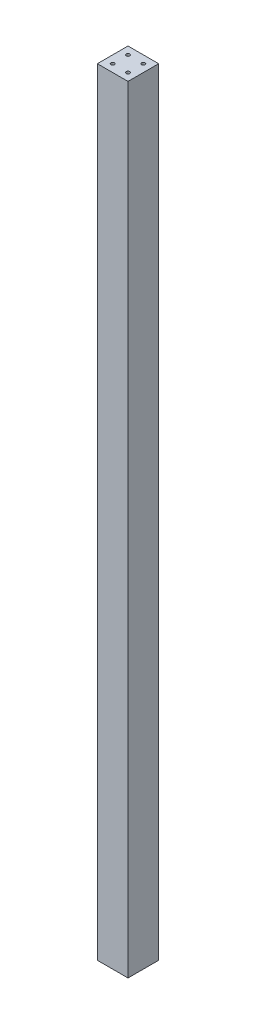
ISO-10303-21;
HEADER;
FILE_DESCRIPTION(('STEP AP214'),'2;1');
FILE_NAME('part.step','',(''),(''),'','','');
FILE_SCHEMA(('AUTOMOTIVE_DESIGN { 1 0 10303 214 1 1 1 1 }'));
ENDSEC;
DATA;
#1=APPLICATION_CONTEXT('core data for automotive mechanical design processes');
#2=APPLICATION_PROTOCOL_DEFINITION('international standard','automotive_design',2000,#1);
#3=PRODUCT_CONTEXT('',#1,'mechanical');
#4=PRODUCT('Part','Part','',(#3));
#5=PRODUCT_RELATED_PRODUCT_CATEGORY('part','',(#4));
#6=PRODUCT_DEFINITION_FORMATION('','',#4);
#7=PRODUCT_DEFINITION_CONTEXT('part definition',#1,'design');
#8=PRODUCT_DEFINITION('design','',#6,#7);
#9=PRODUCT_DEFINITION_SHAPE('','',#8);
#10=(LENGTH_UNIT() NAMED_UNIT(*) SI_UNIT(.MILLI.,.METRE.));
#11=(NAMED_UNIT(*) PLANE_ANGLE_UNIT() SI_UNIT($,.RADIAN.));
#12=(NAMED_UNIT(*) SI_UNIT($,.STERADIAN.) SOLID_ANGLE_UNIT());
#13=UNCERTAINTY_MEASURE_WITH_UNIT(LENGTH_MEASURE(1.E-05),#10,'distance_accuracy_value','');
#14=(GEOMETRIC_REPRESENTATION_CONTEXT(3) GLOBAL_UNCERTAINTY_ASSIGNED_CONTEXT((#13)) GLOBAL_UNIT_ASSIGNED_CONTEXT((#10,
#11,#12)) REPRESENTATION_CONTEXT('',''));
#15=CARTESIAN_POINT('',(0.,0.,0.));
#16=DIRECTION('',(0.,0.,1.));
#17=DIRECTION('',(1.,0.,0.));
#18=AXIS2_PLACEMENT_3D('',#15,#16,#17);
#19=CARTESIAN_POINT('',(-15.,1520.,15.));
#20=DIRECTION('',(0.,1.,0.));
#21=DIRECTION('',(0.,0.,1.));
#22=AXIS2_PLACEMENT_3D('',#19,#20,#21);
#23=CYLINDRICAL_SURFACE('',#22,3.39999999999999);
#24=CARTESIAN_POINT('',(-15.,1502.29292610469,15.));
#25=DIRECTION('',(0.,1.,0.));
#26=DIRECTION('',(0.,0.,1.));
#27=AXIS2_PLACEMENT_3D('',#24,#25,#26);
#28=CIRCLE('',#27,3.4);
#29=CARTESIAN_POINT('',(-15.,1502.29292610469,18.4));
#30=VERTEX_POINT('',#29);
#31=EDGE_CURVE('E11',#30,#30,#28,.T.);
#32=ORIENTED_EDGE('',*,*,#31,.F.);
#33=EDGE_LOOP('',(#32));
#34=FACE_BOUND('',#33,.T.);
#35=CARTESIAN_POINT('',(-15.,1520.,15.));
#36=DIRECTION('',(0.,1.,0.));
#37=DIRECTION('',(0.,0.,1.));
#38=AXIS2_PLACEMENT_3D('',#35,#36,#37);
#39=CIRCLE('',#38,3.39999999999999);
#40=CARTESIAN_POINT('',(-15.,1520.,18.4));
#41=VERTEX_POINT('',#40);
#42=EDGE_CURVE('E61',#41,#41,#39,.T.);
#43=ORIENTED_EDGE('',*,*,#42,.T.);
#44=EDGE_LOOP('',(#43));
#45=FACE_BOUND('',#44,.T.);
#46=ADVANCED_FACE('F53',(#34,#45),#23,.F.);
#47=CARTESIAN_POINT('',(-15.,1502.29292610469,15.));
#48=DIRECTION('',(0.,1.,0.));
#49=DIRECTION('',(0.,0.,1.));
#50=AXIS2_PLACEMENT_3D('',#47,#48,#49);
#51=CONICAL_SURFACE('',#50,3.4,1.02974425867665);
#52=CARTESIAN_POINT('',(-15.,1500.25,15.));
#53=VERTEX_POINT('',#52);
#54=VERTEX_LOOP('',#53);
#55=FACE_BOUND('',#54,.T.);
#56=ORIENTED_EDGE('',*,*,#31,.T.);
#57=EDGE_LOOP('',(#56));
#58=FACE_BOUND('',#57,.T.);
#59=ADVANCED_FACE('F242',(#55,#58),#51,.F.);
#60=CARTESIAN_POINT('',(15.,1520.,15.));
#61=DIRECTION('',(0.,1.,0.));
#62=DIRECTION('',(0.,0.,1.));
#63=AXIS2_PLACEMENT_3D('',#60,#61,#62);
#64=CYLINDRICAL_SURFACE('',#63,3.39999999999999);
#65=CARTESIAN_POINT('',(15.,1502.29292610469,15.));
#66=DIRECTION('',(0.,1.,0.));
#67=DIRECTION('',(0.,0.,1.));
#68=AXIS2_PLACEMENT_3D('',#65,#66,#67);
#69=CIRCLE('',#68,3.4);
#70=CARTESIAN_POINT('',(15.,1502.29292610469,18.4));
#71=VERTEX_POINT('',#70);
#72=EDGE_CURVE('E213',#71,#71,#69,.T.);
#73=ORIENTED_EDGE('',*,*,#72,.F.);
#74=EDGE_LOOP('',(#73));
#75=FACE_BOUND('',#74,.T.);
#76=CARTESIAN_POINT('',(15.,1520.,15.));
#77=DIRECTION('',(0.,1.,0.));
#78=DIRECTION('',(0.,0.,1.));
#79=AXIS2_PLACEMENT_3D('',#76,#77,#78);
#80=CIRCLE('',#79,3.39999999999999);
#81=CARTESIAN_POINT('',(15.,1520.,18.4));
#82=VERTEX_POINT('',#81);
#83=EDGE_CURVE('E209',#82,#82,#80,.T.);
#84=ORIENTED_EDGE('',*,*,#83,.T.);
#85=EDGE_LOOP('',(#84));
#86=FACE_BOUND('',#85,.T.);
#87=ADVANCED_FACE('F248',(#75,#86),#64,.F.);
#88=CARTESIAN_POINT('',(15.,1502.29292610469,15.));
#89=DIRECTION('',(0.,1.,0.));
#90=DIRECTION('',(0.,0.,1.));
#91=AXIS2_PLACEMENT_3D('',#88,#89,#90);
#92=CONICAL_SURFACE('',#91,3.4,1.02974425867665);
#93=CARTESIAN_POINT('',(15.,1500.25,15.));
#94=VERTEX_POINT('',#93);
#95=VERTEX_LOOP('',#94);
#96=FACE_BOUND('',#95,.T.);
#97=ORIENTED_EDGE('',*,*,#72,.T.);
#98=EDGE_LOOP('',(#97));
#99=FACE_BOUND('',#98,.T.);
#100=ADVANCED_FACE('F255',(#96,#99),#92,.F.);
#101=CARTESIAN_POINT('',(-15.,0.,15.));
#102=DIRECTION('',(0.,-1.,0.));
#103=DIRECTION('',(0.,0.,-1.));
#104=AXIS2_PLACEMENT_3D('',#101,#102,#103);
#105=CYLINDRICAL_SURFACE('',#104,3.39999999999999);
#106=CARTESIAN_POINT('',(-15.,17.7070738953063,15.));
#107=DIRECTION('',(0.,-1.,0.));
#108=DIRECTION('',(0.,0.,-1.));
#109=AXIS2_PLACEMENT_3D('',#106,#107,#108);
#110=CIRCLE('',#109,3.4);
#111=CARTESIAN_POINT('',(-15.,17.7070738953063,11.6));
#112=VERTEX_POINT('',#111);
#113=EDGE_CURVE('E205',#112,#112,#110,.T.);
#114=ORIENTED_EDGE('',*,*,#113,.F.);
#115=EDGE_LOOP('',(#114));
#116=FACE_BOUND('',#115,.T.);
#117=CARTESIAN_POINT('',(-15.,0.,15.));
#118=DIRECTION('',(0.,-1.,0.));
#119=DIRECTION('',(0.,0.,-1.));
#120=AXIS2_PLACEMENT_3D('',#117,#118,#119);
#121=CIRCLE('',#120,3.39999999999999);
#122=CARTESIAN_POINT('',(-15.,0.,11.6));
#123=VERTEX_POINT('',#122);
#124=EDGE_CURVE('E201',#123,#123,#121,.T.);
#125=ORIENTED_EDGE('',*,*,#124,.T.);
#126=EDGE_LOOP('',(#125));
#127=FACE_BOUND('',#126,.T.);
#128=ADVANCED_FACE('F260',(#116,#127),#105,.F.);
#129=CARTESIAN_POINT('',(-15.,17.7070738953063,15.));
#130=DIRECTION('',(0.,-1.,0.));
#131=DIRECTION('',(0.,0.,-1.));
#132=AXIS2_PLACEMENT_3D('',#129,#130,#131);
#133=CONICAL_SURFACE('',#132,3.4,1.02974425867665);
#134=CARTESIAN_POINT('',(-15.,19.75,15.));
#135=VERTEX_POINT('',#134);
#136=VERTEX_LOOP('',#135);
#137=FACE_BOUND('',#136,.T.);
#138=ORIENTED_EDGE('',*,*,#113,.T.);
#139=EDGE_LOOP('',(#138));
#140=FACE_BOUND('',#139,.T.);
#141=ADVANCED_FACE('F263',(#137,#140),#133,.F.);
#142=CARTESIAN_POINT('',(15.,0.,15.));
#143=DIRECTION('',(0.,-1.,0.));
#144=DIRECTION('',(0.,0.,-1.));
#145=AXIS2_PLACEMENT_3D('',#142,#143,#144);
#146=CYLINDRICAL_SURFACE('',#145,3.39999999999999);
#147=CARTESIAN_POINT('',(15.,17.7070738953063,15.));
#148=DIRECTION('',(0.,-1.,0.));
#149=DIRECTION('',(0.,0.,-1.));
#150=AXIS2_PLACEMENT_3D('',#147,#148,#149);
#151=CIRCLE('',#150,3.4);
#152=CARTESIAN_POINT('',(15.,17.7070738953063,11.6));
#153=VERTEX_POINT('',#152);
#154=EDGE_CURVE('E197',#153,#153,#151,.T.);
#155=ORIENTED_EDGE('',*,*,#154,.F.);
#156=EDGE_LOOP('',(#155));
#157=FACE_BOUND('',#156,.T.);
#158=CARTESIAN_POINT('',(15.,0.,15.));
#159=DIRECTION('',(0.,-1.,0.));
#160=DIRECTION('',(0.,0.,-1.));
#161=AXIS2_PLACEMENT_3D('',#158,#159,#160);
#162=CIRCLE('',#161,3.39999999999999);
#163=CARTESIAN_POINT('',(15.,0.,11.6));
#164=VERTEX_POINT('',#163);
#165=EDGE_CURVE('E193',#164,#164,#162,.T.);
#166=ORIENTED_EDGE('',*,*,#165,.T.);
#167=EDGE_LOOP('',(#166));
#168=FACE_BOUND('',#167,.T.);
#169=ADVANCED_FACE('F267',(#157,#168),#146,.F.);
#170=CARTESIAN_POINT('',(15.,17.7070738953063,15.));
#171=DIRECTION('',(0.,-1.,0.));
#172=DIRECTION('',(0.,0.,-1.));
#173=AXIS2_PLACEMENT_3D('',#170,#171,#172);
#174=CONICAL_SURFACE('',#173,3.4,1.02974425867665);
#175=CARTESIAN_POINT('',(15.,19.75,15.));
#176=VERTEX_POINT('',#175);
#177=VERTEX_LOOP('',#176);
#178=FACE_BOUND('',#177,.T.);
#179=ORIENTED_EDGE('',*,*,#154,.T.);
#180=EDGE_LOOP('',(#179));
#181=FACE_BOUND('',#180,.T.);
#182=ADVANCED_FACE('F271',(#178,#181),#174,.F.);
#183=CARTESIAN_POINT('',(30.,1520.,-30.));
#184=DIRECTION('',(-1.,0.,0.));
#185=DIRECTION('',(0.,0.,1.));
#186=AXIS2_PLACEMENT_3D('',#183,#184,#185);
#187=PLANE('',#186);
#188=DIRECTION('',(0.,0.,-1.));
#189=VECTOR('',#188,1.);
#190=CARTESIAN_POINT('',(30.,0.,-30.));
#191=LINE('',#190,#189);
#192=CARTESIAN_POINT('',(30.,0.,30.));
#193=VERTEX_POINT('',#192);
#194=CARTESIAN_POINT('',(30.,0.,-30.));
#195=VERTEX_POINT('',#194);
#196=EDGE_CURVE('E151',#193,#195,#191,.T.);
#197=ORIENTED_EDGE('',*,*,#196,.T.);
#198=DIRECTION('',(0.,-1.,0.));
#199=VECTOR('',#198,1.);
#200=CARTESIAN_POINT('',(30.,1520.,-30.));
#201=LINE('',#200,#199);
#202=CARTESIAN_POINT('',(30.,1520.,-30.));
#203=VERTEX_POINT('',#202);
#204=EDGE_CURVE('E189',#203,#195,#201,.T.);
#205=ORIENTED_EDGE('',*,*,#204,.F.);
#206=DIRECTION('',(0.,0.,-1.));
#207=VECTOR('',#206,1.);
#208=CARTESIAN_POINT('',(30.,1520.,-30.));
#209=LINE('',#208,#207);
#210=CARTESIAN_POINT('',(30.,1520.,30.));
#211=VERTEX_POINT('',#210);
#212=EDGE_CURVE('E152',#211,#203,#209,.T.);
#213=ORIENTED_EDGE('',*,*,#212,.F.);
#214=DIRECTION('',(0.,-1.,0.));
#215=VECTOR('',#214,1.);
#216=CARTESIAN_POINT('',(30.,1520.,30.));
#217=LINE('',#216,#215);
#218=EDGE_CURVE('E166',#211,#193,#217,.T.);
#219=ORIENTED_EDGE('',*,*,#218,.T.);
#220=EDGE_LOOP('',(#197,#205,#213,#219));
#221=FACE_BOUND('',#220,.T.);
#222=ADVANCED_FACE('F275',(#221),#187,.F.);
#223=CARTESIAN_POINT('',(-30.,1520.,-30.));
#224=DIRECTION('',(0.,0.,1.));
#225=DIRECTION('',(1.,0.,0.));
#226=AXIS2_PLACEMENT_3D('',#223,#224,#225);
#227=PLANE('',#226);
#228=DIRECTION('',(-1.,0.,0.));
#229=VECTOR('',#228,1.);
#230=CARTESIAN_POINT('',(-30.,0.,-30.));
#231=LINE('',#230,#229);
#232=CARTESIAN_POINT('',(-30.,0.,-30.));
#233=VERTEX_POINT('',#232);
#234=EDGE_CURVE('E170',#195,#233,#231,.T.);
#235=ORIENTED_EDGE('',*,*,#234,.T.);
#236=DIRECTION('',(0.,-1.,0.));
#237=VECTOR('',#236,1.);
#238=CARTESIAN_POINT('',(-30.,1520.,-30.));
#239=LINE('',#238,#237);
#240=CARTESIAN_POINT('',(-30.,1520.,-30.));
#241=VERTEX_POINT('',#240);
#242=EDGE_CURVE('E185',#241,#233,#239,.T.);
#243=ORIENTED_EDGE('',*,*,#242,.F.);
#244=DIRECTION('',(-1.,0.,0.));
#245=VECTOR('',#244,1.);
#246=CARTESIAN_POINT('',(-30.,1520.,-30.));
#247=LINE('',#246,#245);
#248=EDGE_CURVE('E156',#203,#241,#247,.T.);
#249=ORIENTED_EDGE('',*,*,#248,.F.);
#250=ORIENTED_EDGE('',*,*,#204,.T.);
#251=EDGE_LOOP('',(#235,#243,#249,#250));
#252=FACE_BOUND('',#251,.T.);
#253=ADVANCED_FACE('F279',(#252),#227,.F.);
#254=CARTESIAN_POINT('',(-30.,1520.,-30.));
#255=DIRECTION('',(1.,0.,0.));
#256=DIRECTION('',(0.,0.,-1.));
#257=AXIS2_PLACEMENT_3D('',#254,#255,#256);
#258=PLANE('',#257);
#259=DIRECTION('',(0.,0.,1.));
#260=VECTOR('',#259,1.);
#261=CARTESIAN_POINT('',(-30.,0.,-30.));
#262=LINE('',#261,#260);
#263=CARTESIAN_POINT('',(-30.,0.,30.));
#264=VERTEX_POINT('',#263);
#265=EDGE_CURVE('E173',#233,#264,#262,.T.);
#266=ORIENTED_EDGE('',*,*,#265,.T.);
#267=DIRECTION('',(0.,-1.,0.));
#268=VECTOR('',#267,1.);
#269=CARTESIAN_POINT('',(-30.,1520.,30.));
#270=LINE('',#269,#268);
#271=CARTESIAN_POINT('',(-30.,1520.,30.));
#272=VERTEX_POINT('',#271);
#273=EDGE_CURVE('E181',#272,#264,#270,.T.);
#274=ORIENTED_EDGE('',*,*,#273,.F.);
#275=DIRECTION('',(0.,0.,1.));
#276=VECTOR('',#275,1.);
#277=CARTESIAN_POINT('',(-30.,1520.,-30.));
#278=LINE('',#277,#276);
#279=EDGE_CURVE('E160',#241,#272,#278,.T.);
#280=ORIENTED_EDGE('',*,*,#279,.F.);
#281=ORIENTED_EDGE('',*,*,#242,.T.);
#282=EDGE_LOOP('',(#266,#274,#280,#281));
#283=FACE_BOUND('',#282,.T.);
#284=ADVANCED_FACE('F235',(#283),#258,.F.);
#285=CARTESIAN_POINT('',(-30.,1520.,30.));
#286=DIRECTION('',(0.,0.,-1.));
#287=DIRECTION('',(-1.,0.,0.));
#288=AXIS2_PLACEMENT_3D('',#285,#286,#287);
#289=PLANE('',#288);
#290=DIRECTION('',(1.,0.,0.));
#291=VECTOR('',#290,1.);
#292=CARTESIAN_POINT('',(-30.,0.,30.));
#293=LINE('',#292,#291);
#294=EDGE_CURVE('E157',#264,#193,#293,.T.);
#295=ORIENTED_EDGE('',*,*,#294,.T.);
#296=ORIENTED_EDGE('',*,*,#218,.F.);
#297=DIRECTION('',(1.,0.,0.));
#298=VECTOR('',#297,1.);
#299=CARTESIAN_POINT('',(-30.,1520.,30.));
#300=LINE('',#299,#298);
#301=EDGE_CURVE('E163',#272,#211,#300,.T.);
#302=ORIENTED_EDGE('',*,*,#301,.F.);
#303=ORIENTED_EDGE('',*,*,#273,.T.);
#304=EDGE_LOOP('',(#295,#296,#302,#303));
#305=FACE_BOUND('',#304,.T.);
#306=ADVANCED_FACE('F224',(#305),#289,.F.);
#307=CARTESIAN_POINT('',(0.,1520.,0.));
#308=DIRECTION('',(0.,1.,0.));
#309=DIRECTION('',(0.,0.,1.));
#310=AXIS2_PLACEMENT_3D('',#307,#308,#309);
#311=PLANE('',#310);
#312=CARTESIAN_POINT('',(-15.,1520.,-15.));
#313=DIRECTION('',(0.,1.,0.));
#314=DIRECTION('',(0.,0.,1.));
#315=AXIS2_PLACEMENT_3D('',#312,#313,#314);
#316=CIRCLE('',#315,3.39999999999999);
#317=CARTESIAN_POINT('',(-15.,1520.,-11.6));
#318=VERTEX_POINT('',#317);
#319=EDGE_CURVE('E122',#318,#318,#316,.T.);
#320=ORIENTED_EDGE('',*,*,#319,.F.);
#321=EDGE_LOOP('',(#320));
#322=FACE_BOUND('',#321,.T.);
#323=CARTESIAN_POINT('',(15.,1520.,-15.));
#324=DIRECTION('',(0.,1.,0.));
#325=DIRECTION('',(0.,0.,1.));
#326=AXIS2_PLACEMENT_3D('',#323,#324,#325);
#327=CIRCLE('',#326,3.39999999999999);
#328=CARTESIAN_POINT('',(15.,1520.,-11.6));
#329=VERTEX_POINT('',#328);
#330=EDGE_CURVE('E121',#329,#329,#327,.T.);
#331=ORIENTED_EDGE('',*,*,#330,.F.);
#332=EDGE_LOOP('',(#331));
#333=FACE_BOUND('',#332,.T.);
#334=ORIENTED_EDGE('',*,*,#212,.T.);
#335=ORIENTED_EDGE('',*,*,#248,.T.);
#336=ORIENTED_EDGE('',*,*,#279,.T.);
#337=ORIENTED_EDGE('',*,*,#301,.T.);
#338=EDGE_LOOP('',(#334,#335,#336,#337));
#339=FACE_BOUND('',#338,.T.);
#340=ORIENTED_EDGE('',*,*,#83,.F.);
#341=EDGE_LOOP('',(#340));
#342=FACE_BOUND('',#341,.T.);
#343=ORIENTED_EDGE('',*,*,#42,.F.);
#344=EDGE_LOOP('',(#343));
#345=FACE_BOUND('',#344,.T.);
#346=ADVANCED_FACE('F221',(#322,#333,#339,#342,#345),#311,.T.);
#347=CARTESIAN_POINT('',(0.,0.,0.));
#348=DIRECTION('',(0.,1.,0.));
#349=DIRECTION('',(0.,0.,1.));
#350=AXIS2_PLACEMENT_3D('',#347,#348,#349);
#351=PLANE('',#350);
#352=CARTESIAN_POINT('',(-15.,0.,-15.));
#353=DIRECTION('',(0.,-1.,0.));
#354=DIRECTION('',(0.,0.,-1.));
#355=AXIS2_PLACEMENT_3D('',#352,#353,#354);
#356=CIRCLE('',#355,3.39999999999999);
#357=CARTESIAN_POINT('',(-15.,0.,-18.4));
#358=VERTEX_POINT('',#357);
#359=EDGE_CURVE('E135',#358,#358,#356,.T.);
#360=ORIENTED_EDGE('',*,*,#359,.F.);
#361=EDGE_LOOP('',(#360));
#362=FACE_BOUND('',#361,.T.);
#363=CARTESIAN_POINT('',(15.,0.,-15.));
#364=DIRECTION('',(0.,-1.,0.));
#365=DIRECTION('',(0.,0.,-1.));
#366=AXIS2_PLACEMENT_3D('',#363,#364,#365);
#367=CIRCLE('',#366,3.39999999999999);
#368=CARTESIAN_POINT('',(15.,0.,-18.4));
#369=VERTEX_POINT('',#368);
#370=EDGE_CURVE('E143',#369,#369,#367,.T.);
#371=ORIENTED_EDGE('',*,*,#370,.F.);
#372=EDGE_LOOP('',(#371));
#373=FACE_BOUND('',#372,.T.);
#374=ORIENTED_EDGE('',*,*,#196,.F.);
#375=ORIENTED_EDGE('',*,*,#294,.F.);
#376=ORIENTED_EDGE('',*,*,#265,.F.);
#377=ORIENTED_EDGE('',*,*,#234,.F.);
#378=EDGE_LOOP('',(#374,#375,#376,#377));
#379=FACE_BOUND('',#378,.T.);
#380=ORIENTED_EDGE('',*,*,#165,.F.);
#381=EDGE_LOOP('',(#380));
#382=FACE_BOUND('',#381,.T.);
#383=ORIENTED_EDGE('',*,*,#124,.F.);
#384=EDGE_LOOP('',(#383));
#385=FACE_BOUND('',#384,.T.);
#386=ADVANCED_FACE('F223',(#362,#373,#379,#382,#385),#351,.F.);
#387=CARTESIAN_POINT('',(15.,17.7070738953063,-15.));
#388=DIRECTION('',(0.,-1.,0.));
#389=DIRECTION('',(0.,0.,-1.));
#390=AXIS2_PLACEMENT_3D('',#387,#388,#389);
#391=CONICAL_SURFACE('',#390,3.4,1.02974425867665);
#392=CARTESIAN_POINT('',(15.,19.75,-15.));
#393=VERTEX_POINT('',#392);
#394=VERTEX_LOOP('',#393);
#395=FACE_BOUND('',#394,.T.);
#396=CARTESIAN_POINT('',(15.,17.7070738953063,-15.));
#397=DIRECTION('',(0.,-1.,0.));
#398=DIRECTION('',(0.,0.,-1.));
#399=AXIS2_PLACEMENT_3D('',#396,#397,#398);
#400=CIRCLE('',#399,3.4);
#401=CARTESIAN_POINT('',(15.,17.7070738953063,-18.4));
#402=VERTEX_POINT('',#401);
#403=EDGE_CURVE('E147',#402,#402,#400,.T.);
#404=ORIENTED_EDGE('',*,*,#403,.T.);
#405=EDGE_LOOP('',(#404));
#406=FACE_BOUND('',#405,.T.);
#407=ADVANCED_FACE('F231',(#395,#406),#391,.F.);
#408=CARTESIAN_POINT('',(15.,0.,-15.));
#409=DIRECTION('',(0.,-1.,0.));
#410=DIRECTION('',(0.,0.,-1.));
#411=AXIS2_PLACEMENT_3D('',#408,#409,#410);
#412=CYLINDRICAL_SURFACE('',#411,3.39999999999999);
#413=ORIENTED_EDGE('',*,*,#403,.F.);
#414=EDGE_LOOP('',(#413));
#415=FACE_BOUND('',#414,.T.);
#416=ORIENTED_EDGE('',*,*,#370,.T.);
#417=EDGE_LOOP('',(#416));
#418=FACE_BOUND('',#417,.T.);
#419=ADVANCED_FACE('F323',(#415,#418),#412,.F.);
#420=CARTESIAN_POINT('',(-15.,17.7070738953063,-15.));
#421=DIRECTION('',(0.,-1.,0.));
#422=DIRECTION('',(0.,0.,-1.));
#423=AXIS2_PLACEMENT_3D('',#420,#421,#422);
#424=CONICAL_SURFACE('',#423,3.4,1.02974425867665);
#425=CARTESIAN_POINT('',(-15.,19.75,-15.));
#426=VERTEX_POINT('',#425);
#427=VERTEX_LOOP('',#426);
#428=FACE_BOUND('',#427,.T.);
#429=CARTESIAN_POINT('',(-15.,17.7070738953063,-15.));
#430=DIRECTION('',(0.,-1.,0.));
#431=DIRECTION('',(0.,0.,-1.));
#432=AXIS2_PLACEMENT_3D('',#429,#430,#431);
#433=CIRCLE('',#432,3.4);
#434=CARTESIAN_POINT('',(-15.,17.7070738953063,-18.4));
#435=VERTEX_POINT('',#434);
#436=EDGE_CURVE('E139',#435,#435,#433,.T.);
#437=ORIENTED_EDGE('',*,*,#436,.T.);
#438=EDGE_LOOP('',(#437));
#439=FACE_BOUND('',#438,.T.);
#440=ADVANCED_FACE('F334',(#428,#439),#424,.F.);
#441=CARTESIAN_POINT('',(-15.,0.,-15.));
#442=DIRECTION('',(0.,-1.,0.));
#443=DIRECTION('',(0.,0.,-1.));
#444=AXIS2_PLACEMENT_3D('',#441,#442,#443);
#445=CYLINDRICAL_SURFACE('',#444,3.39999999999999);
#446=ORIENTED_EDGE('',*,*,#436,.F.);
#447=EDGE_LOOP('',(#446));
#448=FACE_BOUND('',#447,.T.);
#449=ORIENTED_EDGE('',*,*,#359,.T.);
#450=EDGE_LOOP('',(#449));
#451=FACE_BOUND('',#450,.T.);
#452=ADVANCED_FACE('F380',(#448,#451),#445,.F.);
#453=CARTESIAN_POINT('',(15.,1502.29292610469,-15.));
#454=DIRECTION('',(0.,1.,0.));
#455=DIRECTION('',(0.,0.,1.));
#456=AXIS2_PLACEMENT_3D('',#453,#454,#455);
#457=CONICAL_SURFACE('',#456,3.4,1.02974425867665);
#458=CARTESIAN_POINT('',(15.,1500.25,-15.));
#459=VERTEX_POINT('',#458);
#460=VERTEX_LOOP('',#459);
#461=FACE_BOUND('',#460,.T.);
#462=CARTESIAN_POINT('',(15.,1502.29292610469,-15.));
#463=DIRECTION('',(0.,1.,0.));
#464=DIRECTION('',(0.,0.,1.));
#465=AXIS2_PLACEMENT_3D('',#462,#463,#464);
#466=CIRCLE('',#465,3.4);
#467=CARTESIAN_POINT('',(15.,1502.29292610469,-11.6));
#468=VERTEX_POINT('',#467);
#469=EDGE_CURVE('E127',#468,#468,#466,.T.);
#470=ORIENTED_EDGE('',*,*,#469,.T.);
#471=EDGE_LOOP('',(#470));
#472=FACE_BOUND('',#471,.T.);
#473=ADVANCED_FACE('F390',(#461,#472),#457,.F.);
#474=CARTESIAN_POINT('',(15.,1520.,-15.));
#475=DIRECTION('',(0.,1.,0.));
#476=DIRECTION('',(0.,0.,1.));
#477=AXIS2_PLACEMENT_3D('',#474,#475,#476);
#478=CYLINDRICAL_SURFACE('',#477,3.39999999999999);
#479=ORIENTED_EDGE('',*,*,#469,.F.);
#480=EDGE_LOOP('',(#479));
#481=FACE_BOUND('',#480,.T.);
#482=ORIENTED_EDGE('',*,*,#330,.T.);
#483=EDGE_LOOP('',(#482));
#484=FACE_BOUND('',#483,.T.);
#485=ADVANCED_FACE('F114',(#481,#484),#478,.F.);
#486=CARTESIAN_POINT('',(-15.,1502.29292610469,-15.));
#487=DIRECTION('',(0.,1.,0.));
#488=DIRECTION('',(0.,0.,1.));
#489=AXIS2_PLACEMENT_3D('',#486,#487,#488);
#490=CONICAL_SURFACE('',#489,3.4,1.02974425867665);
#491=CARTESIAN_POINT('',(-15.,1500.25,-15.));
#492=VERTEX_POINT('',#491);
#493=VERTEX_LOOP('',#492);
#494=FACE_BOUND('',#493,.T.);
#495=CARTESIAN_POINT('',(-15.,1502.29292610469,-15.));
#496=DIRECTION('',(0.,1.,0.));
#497=DIRECTION('',(0.,0.,1.));
#498=AXIS2_PLACEMENT_3D('',#495,#496,#497);
#499=CIRCLE('',#498,3.4);
#500=CARTESIAN_POINT('',(-15.,1502.29292610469,-11.6));
#501=VERTEX_POINT('',#500);
#502=EDGE_CURVE('E118',#501,#501,#499,.T.);
#503=ORIENTED_EDGE('',*,*,#502,.T.);
#504=EDGE_LOOP('',(#503));
#505=FACE_BOUND('',#504,.T.);
#506=ADVANCED_FACE('F110',(#494,#505),#490,.F.);
#507=CARTESIAN_POINT('',(-15.,1520.,-15.));
#508=DIRECTION('',(0.,1.,0.));
#509=DIRECTION('',(0.,0.,1.));
#510=AXIS2_PLACEMENT_3D('',#507,#508,#509);
#511=CYLINDRICAL_SURFACE('',#510,3.39999999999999);
#512=ORIENTED_EDGE('',*,*,#502,.F.);
#513=EDGE_LOOP('',(#512));
#514=FACE_BOUND('',#513,.T.);
#515=ORIENTED_EDGE('',*,*,#319,.T.);
#516=EDGE_LOOP('',(#515));
#517=FACE_BOUND('',#516,.T.);
#518=ADVANCED_FACE('F113',(#514,#517),#511,.F.);
#519=CLOSED_SHELL('',(#46,#59,#87,#100,#128,#141,#169,#182,#222,#253,#284,#306,#346,#386,#407,
#419,#440,#452,#473,#485,#506,#518));
#520=MANIFOLD_SOLID_BREP('B2',#519);
#521=ADVANCED_BREP_SHAPE_REPRESENTATION('',(#18,#520),#14);
#522=SHAPE_DEFINITION_REPRESENTATION(#9,#521);
ENDSEC;
END-ISO-10303-21;
